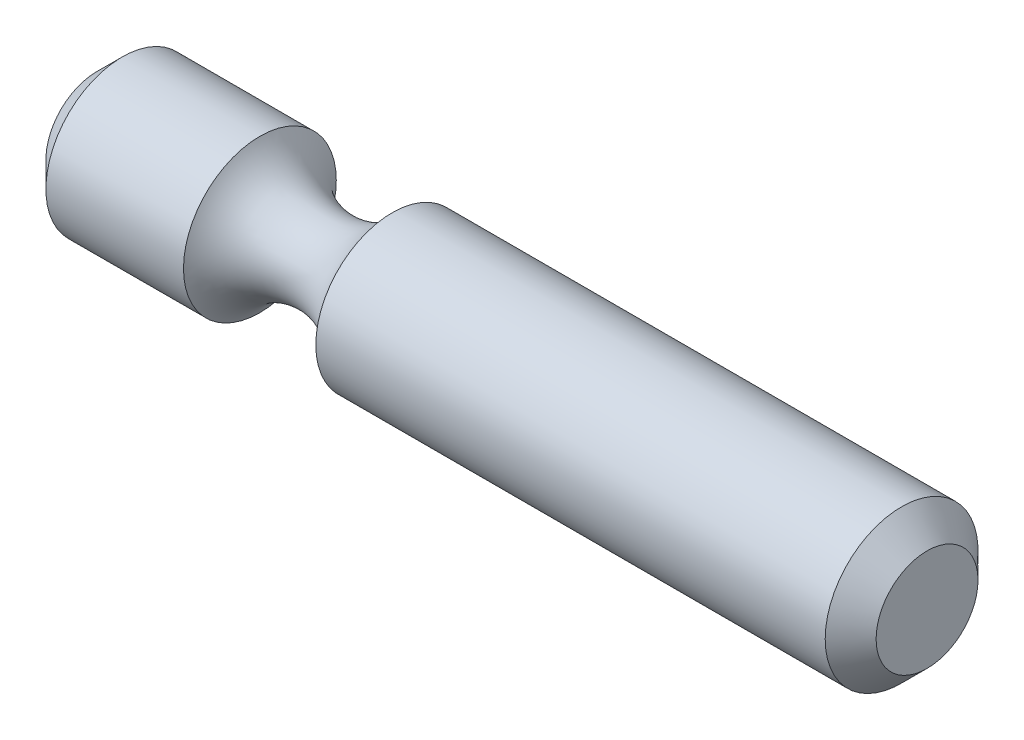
ISO-10303-21;
HEADER;
FILE_DESCRIPTION(('STEP AP214'),'2;1');
FILE_NAME('part.step','',(''),(''),'','','');
FILE_SCHEMA(('AUTOMOTIVE_DESIGN { 1 0 10303 214 1 1 1 1 }'));
ENDSEC;
DATA;
#1=APPLICATION_CONTEXT('core data for automotive mechanical design processes');
#2=APPLICATION_PROTOCOL_DEFINITION('international standard','automotive_design',2000,#1);
#3=PRODUCT_CONTEXT('',#1,'mechanical');
#4=PRODUCT('Part','Part','',(#3));
#5=PRODUCT_RELATED_PRODUCT_CATEGORY('part','',(#4));
#6=PRODUCT_DEFINITION_FORMATION('','',#4);
#7=PRODUCT_DEFINITION_CONTEXT('part definition',#1,'design');
#8=PRODUCT_DEFINITION('design','',#6,#7);
#9=PRODUCT_DEFINITION_SHAPE('','',#8);
#10=(LENGTH_UNIT() NAMED_UNIT(*) SI_UNIT(.MILLI.,.METRE.));
#11=(NAMED_UNIT(*) PLANE_ANGLE_UNIT() SI_UNIT($,.RADIAN.));
#12=(NAMED_UNIT(*) SI_UNIT($,.STERADIAN.) SOLID_ANGLE_UNIT());
#13=UNCERTAINTY_MEASURE_WITH_UNIT(LENGTH_MEASURE(1.E-05),#10,'distance_accuracy_value','');
#14=(GEOMETRIC_REPRESENTATION_CONTEXT(3) GLOBAL_UNCERTAINTY_ASSIGNED_CONTEXT((#13)) GLOBAL_UNIT_ASSIGNED_CONTEXT((#10,
#11,#12)) REPRESENTATION_CONTEXT('',''));
#15=CARTESIAN_POINT('',(0.,0.,0.));
#16=DIRECTION('',(0.,0.,1.));
#17=DIRECTION('',(1.,0.,0.));
#18=AXIS2_PLACEMENT_3D('',#15,#16,#17);
#19=CARTESIAN_POINT('',(0.,-2.25,0.));
#20=DIRECTION('',(-1.,0.,0.));
#21=DIRECTION('',(0.,0.,1.));
#22=AXIS2_PLACEMENT_3D('',#19,#20,#21);
#23=TOROIDAL_SURFACE('',#22,2.25,1.5);
#24=CARTESIAN_POINT('',(-1.29903810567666,-2.25,0.));
#25=DIRECTION('',(-1.,0.,0.));
#26=DIRECTION('',(0.,0.,1.));
#27=AXIS2_PLACEMENT_3D('',#24,#25,#26);
#28=CIRCLE('',#27,1.5);
#29=CARTESIAN_POINT('',(-1.29903810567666,-2.25,1.5));
#30=VERTEX_POINT('',#29);
#31=EDGE_CURVE('E44',#30,#30,#28,.T.);
#32=ORIENTED_EDGE('',*,*,#31,.F.);
#33=EDGE_LOOP('',(#32));
#34=FACE_BOUND('',#33,.T.);
#35=CARTESIAN_POINT('',(1.29903810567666,-2.25,0.));
#36=DIRECTION('',(1.,0.,0.));
#37=DIRECTION('',(0.,0.,-1.));
#38=AXIS2_PLACEMENT_3D('',#35,#36,#37);
#39=CIRCLE('',#38,1.5);
#40=CARTESIAN_POINT('',(1.29903810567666,-2.25,1.5));
#41=VERTEX_POINT('',#40);
#42=EDGE_CURVE('E47',#41,#41,#39,.T.);
#43=ORIENTED_EDGE('',*,*,#42,.F.);
#44=EDGE_LOOP('',(#43));
#45=FACE_BOUND('',#44,.T.);
#46=ADVANCED_FACE('F25',(#34,#45),#23,.F.);
#47=CARTESIAN_POINT('',(11.7990381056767,-2.25,0.));
#48=DIRECTION('',(-1.,0.,0.));
#49=DIRECTION('',(0.,0.,1.));
#50=AXIS2_PLACEMENT_3D('',#47,#48,#49);
#51=CYLINDRICAL_SURFACE('',#50,1.5);
#52=CARTESIAN_POINT('',(11.2990381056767,-2.25,0.));
#53=DIRECTION('',(1.,0.,0.));
#54=DIRECTION('',(0.,0.,-1.));
#55=AXIS2_PLACEMENT_3D('',#52,#53,#54);
#56=CIRCLE('',#55,1.5);
#57=CARTESIAN_POINT('',(11.2990381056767,-2.25,1.5));
#58=VERTEX_POINT('',#57);
#59=EDGE_CURVE('E35',#58,#58,#56,.F.);
#60=CARTESIAN_POINT('',(11.2990381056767,-2.25,1.5));
#61=CARTESIAN_POINT('',(11.19487143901,-2.25,1.5));
#62=CARTESIAN_POINT('',(11.0907047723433,-2.25,1.5));
#63=CARTESIAN_POINT('',(10.88237143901,-2.25,1.5));
#64=CARTESIAN_POINT('',(10.7782047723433,-2.25,1.5));
#65=CARTESIAN_POINT('',(10.56987143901,-2.25,1.5));
#66=CARTESIAN_POINT('',(10.4657047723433,-2.25,1.5));
#67=CARTESIAN_POINT('',(10.25737143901,-2.25,1.5));
#68=CARTESIAN_POINT('',(10.1532047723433,-2.25,1.5));
#69=CARTESIAN_POINT('',(9.94487143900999,-2.25,1.5));
#70=CARTESIAN_POINT('',(9.84070477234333,-2.25,1.5));
#71=CARTESIAN_POINT('',(9.63237143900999,-2.25,1.5));
#72=CARTESIAN_POINT('',(9.52820477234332,-2.25,1.5));
#73=CARTESIAN_POINT('',(9.31987143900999,-2.25,1.5));
#74=CARTESIAN_POINT('',(9.21570477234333,-2.25,1.5));
#75=CARTESIAN_POINT('',(9.00737143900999,-2.25,1.5));
#76=CARTESIAN_POINT('',(8.90320477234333,-2.25,1.5));
#77=CARTESIAN_POINT('',(8.69487143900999,-2.25,1.5));
#78=CARTESIAN_POINT('',(8.59070477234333,-2.25,1.5));
#79=CARTESIAN_POINT('',(8.38237143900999,-2.25,1.5));
#80=CARTESIAN_POINT('',(8.27820477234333,-2.25,1.5));
#81=CARTESIAN_POINT('',(8.06987143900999,-2.25,1.5));
#82=CARTESIAN_POINT('',(7.96570477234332,-2.25,1.5));
#83=CARTESIAN_POINT('',(7.75737143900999,-2.25,1.5));
#84=CARTESIAN_POINT('',(7.65320477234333,-2.25,1.5));
#85=CARTESIAN_POINT('',(7.44487143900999,-2.25,1.5));
#86=CARTESIAN_POINT('',(7.34070477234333,-2.25,1.5));
#87=CARTESIAN_POINT('',(7.13237143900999,-2.25,1.5));
#88=CARTESIAN_POINT('',(7.02820477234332,-2.25,1.5));
#89=CARTESIAN_POINT('',(6.81987143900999,-2.25,1.5));
#90=CARTESIAN_POINT('',(6.71570477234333,-2.25,1.5));
#91=CARTESIAN_POINT('',(6.50737143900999,-2.25,1.5));
#92=CARTESIAN_POINT('',(6.40320477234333,-2.25,1.5));
#93=CARTESIAN_POINT('',(6.19487143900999,-2.25,1.5));
#94=CARTESIAN_POINT('',(6.09070477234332,-2.25,1.5));
#95=CARTESIAN_POINT('',(5.88237143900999,-2.25,1.5));
#96=CARTESIAN_POINT('',(5.77820477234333,-2.25,1.5));
#97=CARTESIAN_POINT('',(5.56987143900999,-2.25,1.5));
#98=CARTESIAN_POINT('',(5.46570477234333,-2.25,1.5));
#99=CARTESIAN_POINT('',(5.25737143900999,-2.25,1.5));
#100=CARTESIAN_POINT('',(5.15320477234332,-2.25,1.5));
#101=CARTESIAN_POINT('',(4.94487143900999,-2.25,1.5));
#102=CARTESIAN_POINT('',(4.84070477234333,-2.25,1.5));
#103=CARTESIAN_POINT('',(4.63237143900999,-2.25,1.5));
#104=CARTESIAN_POINT('',(4.52820477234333,-2.25,1.5));
#105=CARTESIAN_POINT('',(4.31987143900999,-2.25,1.5));
#106=CARTESIAN_POINT('',(4.21570477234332,-2.25,1.5));
#107=CARTESIAN_POINT('',(4.00737143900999,-2.25,1.5));
#108=CARTESIAN_POINT('',(3.90320477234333,-2.25,1.5));
#109=CARTESIAN_POINT('',(3.69487143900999,-2.25,1.5));
#110=CARTESIAN_POINT('',(3.59070477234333,-2.25,1.5));
#111=CARTESIAN_POINT('',(3.38237143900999,-2.25,1.5));
#112=CARTESIAN_POINT('',(3.27820477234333,-2.25,1.5));
#113=CARTESIAN_POINT('',(3.06987143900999,-2.25,1.5));
#114=CARTESIAN_POINT('',(2.96570477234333,-2.25,1.5));
#115=CARTESIAN_POINT('',(2.75737143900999,-2.25,1.5));
#116=CARTESIAN_POINT('',(2.65320477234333,-2.25,1.5));
#117=CARTESIAN_POINT('',(2.44487143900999,-2.25,1.5));
#118=CARTESIAN_POINT('',(2.34070477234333,-2.25,1.5));
#119=CARTESIAN_POINT('',(2.13237143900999,-2.25,1.5));
#120=CARTESIAN_POINT('',(2.02820477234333,-2.25,1.5));
#121=CARTESIAN_POINT('',(1.81987143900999,-2.25,1.5));
#122=CARTESIAN_POINT('',(1.71570477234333,-2.25,1.5));
#123=CARTESIAN_POINT('',(1.50737143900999,-2.25,1.5));
#124=CARTESIAN_POINT('',(1.40320477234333,-2.25,1.5));
#125=CARTESIAN_POINT('',(1.29903810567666,-2.25,1.5));
#126=B_SPLINE_CURVE_WITH_KNOTS('',3,(#60,#61,#62,#63,#64,#65,#66,#67,#68,#69,#70,#71,#72,#73,
#74,#75,#76,#77,#78,#79,#80,#81,#82,#83,#84,#85,#86,#87,#88,#89,#90,#91,#92,#93,#94,#95,#96,#97,
#98,#99,#100,#101,#102,#103,#104,#105,#106,#107,#108,#109,#110,#111,#112,#113,#114,#115,#116,
#117,#118,#119,#120,#121,#122,#123,#124,#125),.UNSPECIFIED.,.F.,.F.,(4,2,2,2,2,2,2,2,2,2,2,2,2,
2,2,2,2,2,2,2,2,2,2,2,2,2,2,2,2,2,2,2,4),(0.,0.312499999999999,0.624999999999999,
0.937499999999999,1.25,1.5625,1.875,2.1875,2.5,2.8125,3.125,3.4375,3.75,4.0625,4.375,4.6875,5.,
5.3125,5.625,5.9375,6.25,6.5625,6.875,7.1875,7.5,7.8125,8.125,8.4375,8.75,9.0625,9.375,9.6875,
10.),.UNSPECIFIED.);
#127=EDGE_CURVE('BSEAM51',#58,#41,#126,.T.);
#128=ORIENTED_EDGE('',*,*,#59,.T.);
#129=ORIENTED_EDGE('',*,*,#42,.T.);
#130=ORIENTED_EDGE('',*,*,#127,.T.);
#131=ORIENTED_EDGE('',*,*,#127,.F.);
#132=EDGE_LOOP('',(#128,#130,#129,#131));
#133=FACE_BOUND('',#132,.T.);
#134=ADVANCED_FACE('F51',(#133),#51,.T.);
#135=CARTESIAN_POINT('',(11.7990381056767,-2.25,0.));
#136=DIRECTION('',(1.,0.,0.));
#137=DIRECTION('',(0.,0.,-1.));
#138=AXIS2_PLACEMENT_3D('',#135,#136,#137);
#139=PLANE('',#138);
#140=CARTESIAN_POINT('',(11.7990381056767,-2.25,0.));
#141=DIRECTION('',(1.,0.,0.));
#142=DIRECTION('',(0.,0.,-1.));
#143=AXIS2_PLACEMENT_3D('',#140,#141,#142);
#144=CIRCLE('',#143,1.);
#145=CARTESIAN_POINT('',(11.7990381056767,-2.25,-1.));
#146=VERTEX_POINT('',#145);
#147=EDGE_CURVE('E39',#146,#146,#144,.T.);
#148=ORIENTED_EDGE('',*,*,#147,.T.);
#149=EDGE_LOOP('',(#148));
#150=FACE_BOUND('',#149,.T.);
#151=ADVANCED_FACE('F58',(#150),#139,.T.);
#152=CARTESIAN_POINT('',(11.7990381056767,-2.25,0.));
#153=DIRECTION('',(-1.,0.,0.));
#154=DIRECTION('',(0.,0.,1.));
#155=AXIS2_PLACEMENT_3D('',#152,#153,#154);
#156=CONICAL_SURFACE('',#155,1.,0.785398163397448);
#157=ORIENTED_EDGE('',*,*,#59,.F.);
#158=EDGE_LOOP('',(#157));
#159=FACE_BOUND('',#158,.T.);
#160=ORIENTED_EDGE('',*,*,#147,.F.);
#161=EDGE_LOOP('',(#160));
#162=FACE_BOUND('',#161,.T.);
#163=ADVANCED_FACE('F65',(#159,#162),#156,.T.);
#164=CARTESIAN_POINT('',(-11.3407168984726,-2.25,0.));
#165=DIRECTION('',(1.,0.,0.));
#166=DIRECTION('',(0.,0.,-1.));
#167=AXIS2_PLACEMENT_3D('',#164,#165,#166);
#168=CYLINDRICAL_SURFACE('',#167,1.5);
#169=CARTESIAN_POINT('',(-4.,-2.25,0.));
#170=DIRECTION('',(1.,0.,0.));
#171=DIRECTION('',(0.,0.,-1.));
#172=AXIS2_PLACEMENT_3D('',#169,#170,#171);
#173=CIRCLE('',#172,1.5);
#174=CARTESIAN_POINT('',(-4.,-2.25,-1.5));
#175=VERTEX_POINT('',#174);
#176=EDGE_CURVE('E31',#175,#175,#173,.T.);
#177=ORIENTED_EDGE('',*,*,#176,.T.);
#178=EDGE_LOOP('',(#177));
#179=FACE_BOUND('',#178,.T.);
#180=ORIENTED_EDGE('',*,*,#31,.T.);
#181=EDGE_LOOP('',(#180));
#182=FACE_BOUND('',#181,.T.);
#183=ADVANCED_FACE('F62',(#179,#182),#168,.T.);
#184=CARTESIAN_POINT('',(-4.5,0.,0.));
#185=DIRECTION('',(1.,0.,0.));
#186=DIRECTION('',(0.,0.,-1.));
#187=AXIS2_PLACEMENT_3D('',#184,#185,#186);
#188=PLANE('',#187);
#189=CARTESIAN_POINT('',(-4.5,-2.25,0.));
#190=DIRECTION('',(1.,0.,0.));
#191=DIRECTION('',(0.,0.,-1.));
#192=AXIS2_PLACEMENT_3D('',#189,#190,#191);
#193=CIRCLE('',#192,0.999999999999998);
#194=CARTESIAN_POINT('',(-4.5,-2.25,-0.999999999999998));
#195=VERTEX_POINT('',#194);
#196=EDGE_CURVE('E10',#195,#195,#193,.F.);
#197=ORIENTED_EDGE('',*,*,#196,.T.);
#198=EDGE_LOOP('',(#197));
#199=FACE_BOUND('',#198,.T.);
#200=ADVANCED_FACE('F64',(#199),#188,.F.);
#201=CARTESIAN_POINT('',(-4.,-2.25,0.));
#202=DIRECTION('',(1.,0.,0.));
#203=DIRECTION('',(0.,0.,-1.));
#204=AXIS2_PLACEMENT_3D('',#201,#202,#203);
#205=CONICAL_SURFACE('',#204,1.5,0.78539816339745);
#206=ORIENTED_EDGE('',*,*,#196,.F.);
#207=EDGE_LOOP('',(#206));
#208=FACE_BOUND('',#207,.T.);
#209=ORIENTED_EDGE('',*,*,#176,.F.);
#210=EDGE_LOOP('',(#209));
#211=FACE_BOUND('',#210,.T.);
#212=ADVANCED_FACE('F71',(#208,#211),#205,.T.);
#213=CLOSED_SHELL('',(#46,#134,#151,#163,#183,#200,#212));
#214=MANIFOLD_SOLID_BREP('B2',#213);
#215=ADVANCED_BREP_SHAPE_REPRESENTATION('',(#18,#214),#14);
#216=SHAPE_DEFINITION_REPRESENTATION(#9,#215);
ENDSEC;
END-ISO-10303-21;
